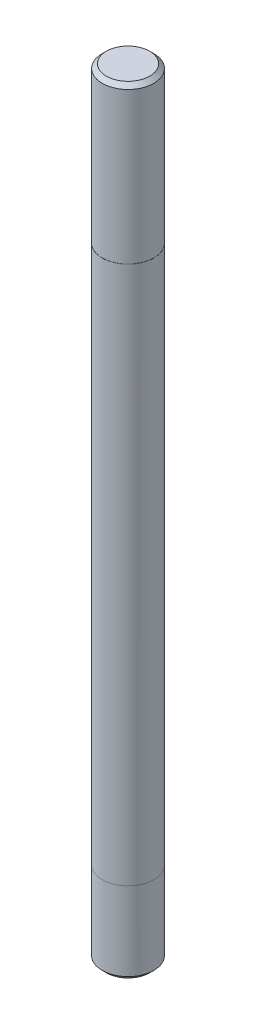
ISO-10303-21;
HEADER;
FILE_DESCRIPTION(('STEP AP214'),'2;1');
FILE_NAME('part.step','',(''),(''),'','','');
FILE_SCHEMA(('AUTOMOTIVE_DESIGN { 1 0 10303 214 1 1 1 1 }'));
ENDSEC;
DATA;
#1=APPLICATION_CONTEXT('core data for automotive mechanical design processes');
#2=APPLICATION_PROTOCOL_DEFINITION('international standard','automotive_design',2000,#1);
#3=PRODUCT_CONTEXT('',#1,'mechanical');
#4=PRODUCT('Part','Part','',(#3));
#5=PRODUCT_RELATED_PRODUCT_CATEGORY('part','',(#4));
#6=PRODUCT_DEFINITION_FORMATION('','',#4);
#7=PRODUCT_DEFINITION_CONTEXT('part definition',#1,'design');
#8=PRODUCT_DEFINITION('design','',#6,#7);
#9=PRODUCT_DEFINITION_SHAPE('','',#8);
#10=(LENGTH_UNIT() NAMED_UNIT(*) SI_UNIT(.MILLI.,.METRE.));
#11=(NAMED_UNIT(*) PLANE_ANGLE_UNIT() SI_UNIT($,.RADIAN.));
#12=(NAMED_UNIT(*) SI_UNIT($,.STERADIAN.) SOLID_ANGLE_UNIT());
#13=UNCERTAINTY_MEASURE_WITH_UNIT(LENGTH_MEASURE(1.E-05),#10,'distance_accuracy_value','');
#14=(GEOMETRIC_REPRESENTATION_CONTEXT(3) GLOBAL_UNCERTAINTY_ASSIGNED_CONTEXT((#13)) GLOBAL_UNIT_ASSIGNED_CONTEXT((#10,
#11,#12)) REPRESENTATION_CONTEXT('',''));
#15=CARTESIAN_POINT('',(0.,0.,0.));
#16=DIRECTION('',(0.,0.,1.));
#17=DIRECTION('',(1.,0.,0.));
#18=AXIS2_PLACEMENT_3D('',#15,#16,#17);
#19=CARTESIAN_POINT('',(0.,75.,0.));
#20=DIRECTION('',(0.,-1.,0.));
#21=DIRECTION('',(0.,0.,-1.));
#22=AXIS2_PLACEMENT_3D('',#19,#20,#21);
#23=CYLINDRICAL_SURFACE('',#22,2.5);
#24=CARTESIAN_POINT('',(0.,60.,0.));
#25=DIRECTION('',(0.,1.,0.));
#26=DIRECTION('',(0.,0.,1.));
#27=AXIS2_PLACEMENT_3D('',#24,#25,#26);
#28=CIRCLE('',#27,2.5);
#29=CARTESIAN_POINT('',(0.,60.,2.5));
#30=VERTEX_POINT('',#29);
#31=EDGE_CURVE('E49',#30,#30,#28,.T.);
#32=ORIENTED_EDGE('',*,*,#31,.F.);
#33=EDGE_LOOP('',(#32));
#34=FACE_BOUND('',#33,.T.);
#35=CARTESIAN_POINT('',(0.,8.,0.));
#36=DIRECTION('',(0.,-1.,0.));
#37=DIRECTION('',(0.,0.,-1.));
#38=AXIS2_PLACEMENT_3D('',#35,#36,#37);
#39=CIRCLE('',#38,2.5);
#40=CARTESIAN_POINT('',(0.,8.,-2.5));
#41=VERTEX_POINT('',#40);
#42=EDGE_CURVE('E55',#41,#41,#39,.T.);
#43=ORIENTED_EDGE('',*,*,#42,.F.);
#44=EDGE_LOOP('',(#43));
#45=FACE_BOUND('',#44,.T.);
#46=ADVANCED_FACE('F30',(#34,#45),#23,.T.);
#47=CARTESIAN_POINT('',(0.,60.,0.));
#48=DIRECTION('',(0.,1.,0.));
#49=DIRECTION('',(0.,0.,1.));
#50=AXIS2_PLACEMENT_3D('',#47,#48,#49);
#51=PLANE('',#50);
#52=CARTESIAN_POINT('',(0.,60.,0.));
#53=DIRECTION('',(0.,1.,0.));
#54=DIRECTION('',(0.,0.,1.));
#55=AXIS2_PLACEMENT_3D('',#52,#53,#54);
#56=CIRCLE('',#55,2.49);
#57=CARTESIAN_POINT('',(0.,60.,2.49));
#58=VERTEX_POINT('',#57);
#59=EDGE_CURVE('E52',#58,#58,#56,.T.);
#60=ORIENTED_EDGE('',*,*,#59,.F.);
#61=EDGE_LOOP('',(#60));
#62=FACE_BOUND('',#61,.T.);
#63=ORIENTED_EDGE('',*,*,#31,.T.);
#64=EDGE_LOOP('',(#63));
#65=FACE_BOUND('',#64,.T.);
#66=ADVANCED_FACE('F72',(#62,#65),#51,.T.);
#67=CARTESIAN_POINT('',(0.,60.,0.));
#68=DIRECTION('',(0.,1.,0.));
#69=DIRECTION('',(0.,0.,1.));
#70=AXIS2_PLACEMENT_3D('',#67,#68,#69);
#71=CYLINDRICAL_SURFACE('',#70,2.49);
#72=CARTESIAN_POINT('',(0.,74.6,0.));
#73=DIRECTION('',(0.,1.,0.));
#74=DIRECTION('',(0.,0.,1.));
#75=AXIS2_PLACEMENT_3D('',#72,#73,#74);
#76=CIRCLE('',#75,2.49);
#77=CARTESIAN_POINT('',(0.,74.6,2.49));
#78=VERTEX_POINT('',#77);
#79=EDGE_CURVE('E10',#78,#78,#76,.F.);
#80=ORIENTED_EDGE('',*,*,#79,.T.);
#81=EDGE_LOOP('',(#80));
#82=FACE_BOUND('',#81,.T.);
#83=ORIENTED_EDGE('',*,*,#59,.T.);
#84=EDGE_LOOP('',(#83));
#85=FACE_BOUND('',#84,.T.);
#86=ADVANCED_FACE('F77',(#82,#85),#71,.T.);
#87=CARTESIAN_POINT('',(0.,75.,0.));
#88=DIRECTION('',(0.,1.,0.));
#89=DIRECTION('',(0.,0.,1.));
#90=AXIS2_PLACEMENT_3D('',#87,#88,#89);
#91=PLANE('',#90);
#92=CARTESIAN_POINT('',(0.,75.,0.));
#93=DIRECTION('',(0.,1.,0.));
#94=DIRECTION('',(0.,0.,1.));
#95=AXIS2_PLACEMENT_3D('',#92,#93,#94);
#96=CIRCLE('',#95,2.09000000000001);
#97=CARTESIAN_POINT('',(0.,75.,2.09000000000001));
#98=VERTEX_POINT('',#97);
#99=EDGE_CURVE('E36',#98,#98,#96,.T.);
#100=ORIENTED_EDGE('',*,*,#99,.T.);
#101=EDGE_LOOP('',(#100));
#102=FACE_BOUND('',#101,.T.);
#103=ADVANCED_FACE('F67',(#102),#91,.T.);
#104=CARTESIAN_POINT('',(0.,8.,0.));
#105=DIRECTION('',(0.,-1.,0.));
#106=DIRECTION('',(0.,0.,-1.));
#107=AXIS2_PLACEMENT_3D('',#104,#105,#106);
#108=PLANE('',#107);
#109=CARTESIAN_POINT('',(0.,8.,0.));
#110=DIRECTION('',(0.,-1.,0.));
#111=DIRECTION('',(0.,0.,-1.));
#112=AXIS2_PLACEMENT_3D('',#109,#110,#111);
#113=CIRCLE('',#112,2.49);
#114=CARTESIAN_POINT('',(0.,8.,-2.49));
#115=VERTEX_POINT('',#114);
#116=EDGE_CURVE('E58',#115,#115,#113,.T.);
#117=ORIENTED_EDGE('',*,*,#116,.F.);
#118=EDGE_LOOP('',(#117));
#119=FACE_BOUND('',#118,.T.);
#120=ORIENTED_EDGE('',*,*,#42,.T.);
#121=EDGE_LOOP('',(#120));
#122=FACE_BOUND('',#121,.T.);
#123=ADVANCED_FACE('F64',(#119,#122),#108,.T.);
#124=CARTESIAN_POINT('',(0.,8.,0.));
#125=DIRECTION('',(0.,-1.,0.));
#126=DIRECTION('',(0.,0.,-1.));
#127=AXIS2_PLACEMENT_3D('',#124,#125,#126);
#128=CYLINDRICAL_SURFACE('',#127,2.49);
#129=CARTESIAN_POINT('',(0.,0.400000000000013,0.));
#130=DIRECTION('',(0.,1.,0.));
#131=DIRECTION('',(0.,0.,1.));
#132=AXIS2_PLACEMENT_3D('',#129,#130,#131);
#133=CIRCLE('',#132,2.49);
#134=CARTESIAN_POINT('',(0.,0.400000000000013,2.49));
#135=VERTEX_POINT('',#134);
#136=EDGE_CURVE('E40',#135,#135,#133,.T.);
#137=ORIENTED_EDGE('',*,*,#136,.T.);
#138=EDGE_LOOP('',(#137));
#139=FACE_BOUND('',#138,.T.);
#140=ORIENTED_EDGE('',*,*,#116,.T.);
#141=EDGE_LOOP('',(#140));
#142=FACE_BOUND('',#141,.T.);
#143=ADVANCED_FACE('F62',(#139,#142),#128,.T.);
#144=CARTESIAN_POINT('',(0.,0.,0.));
#145=DIRECTION('',(0.,1.,0.));
#146=DIRECTION('',(0.,0.,1.));
#147=AXIS2_PLACEMENT_3D('',#144,#145,#146);
#148=PLANE('',#147);
#149=CARTESIAN_POINT('',(0.,0.,0.));
#150=DIRECTION('',(0.,1.,0.));
#151=DIRECTION('',(0.,0.,1.));
#152=AXIS2_PLACEMENT_3D('',#149,#150,#151);
#153=CIRCLE('',#152,2.08999999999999);
#154=CARTESIAN_POINT('',(0.,0.,2.08999999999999));
#155=VERTEX_POINT('',#154);
#156=EDGE_CURVE('E44',#155,#155,#153,.F.);
#157=ORIENTED_EDGE('',*,*,#156,.T.);
#158=EDGE_LOOP('',(#157));
#159=FACE_BOUND('',#158,.T.);
#160=ADVANCED_FACE('F88',(#159),#148,.F.);
#161=CARTESIAN_POINT('',(0.,0.,0.));
#162=DIRECTION('',(0.,1.,0.));
#163=DIRECTION('',(0.,0.,1.));
#164=AXIS2_PLACEMENT_3D('',#161,#162,#163);
#165=CONICAL_SURFACE('',#164,2.08999999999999,0.785398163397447);
#166=ORIENTED_EDGE('',*,*,#136,.F.);
#167=EDGE_LOOP('',(#166));
#168=FACE_BOUND('',#167,.T.);
#169=ORIENTED_EDGE('',*,*,#156,.F.);
#170=EDGE_LOOP('',(#169));
#171=FACE_BOUND('',#170,.T.);
#172=ADVANCED_FACE('F90',(#168,#171),#165,.T.);
#173=CARTESIAN_POINT('',(0.,75.,0.));
#174=DIRECTION('',(0.,-1.,0.));
#175=DIRECTION('',(0.,0.,-1.));
#176=AXIS2_PLACEMENT_3D('',#173,#174,#175);
#177=CONICAL_SURFACE('',#176,2.09000000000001,0.785398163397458);
#178=ORIENTED_EDGE('',*,*,#79,.F.);
#179=EDGE_LOOP('',(#178));
#180=FACE_BOUND('',#179,.T.);
#181=ORIENTED_EDGE('',*,*,#99,.F.);
#182=EDGE_LOOP('',(#181));
#183=FACE_BOUND('',#182,.T.);
#184=ADVANCED_FACE('F118',(#180,#183),#177,.T.);
#185=CLOSED_SHELL('',(#46,#66,#86,#103,#123,#143,#160,#172,#184));
#186=MANIFOLD_SOLID_BREP('B2',#185);
#187=ADVANCED_BREP_SHAPE_REPRESENTATION('',(#18,#186),#14);
#188=SHAPE_DEFINITION_REPRESENTATION(#9,#187);
ENDSEC;
END-ISO-10303-21;
